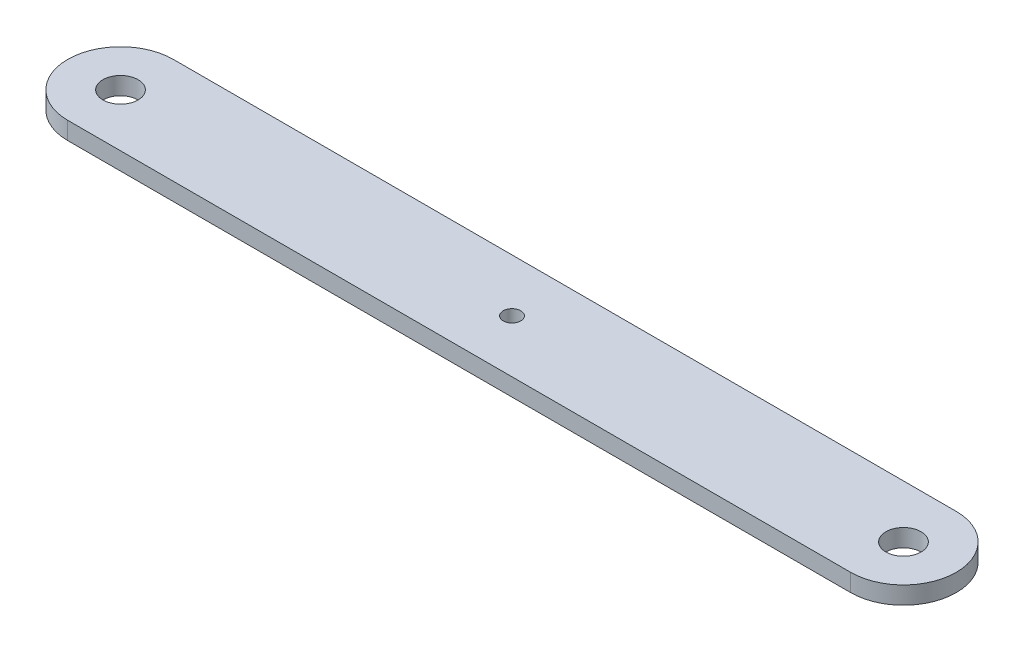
ISO-10303-21;
HEADER;
FILE_DESCRIPTION(('STEP AP214'),'2;1');
FILE_NAME('part.step','',(''),(''),'','','');
FILE_SCHEMA(('AUTOMOTIVE_DESIGN { 1 0 10303 214 1 1 1 1 }'));
ENDSEC;
DATA;
#1=APPLICATION_CONTEXT('core data for automotive mechanical design processes');
#2=APPLICATION_PROTOCOL_DEFINITION('international standard','automotive_design',2000,#1);
#3=PRODUCT_CONTEXT('',#1,'mechanical');
#4=PRODUCT('Part','Part','',(#3));
#5=PRODUCT_RELATED_PRODUCT_CATEGORY('part','',(#4));
#6=PRODUCT_DEFINITION_FORMATION('','',#4);
#7=PRODUCT_DEFINITION_CONTEXT('part definition',#1,'design');
#8=PRODUCT_DEFINITION('design','',#6,#7);
#9=PRODUCT_DEFINITION_SHAPE('','',#8);
#10=(LENGTH_UNIT() NAMED_UNIT(*) SI_UNIT(.MILLI.,.METRE.));
#11=(NAMED_UNIT(*) PLANE_ANGLE_UNIT() SI_UNIT($,.RADIAN.));
#12=(NAMED_UNIT(*) SI_UNIT($,.STERADIAN.) SOLID_ANGLE_UNIT());
#13=UNCERTAINTY_MEASURE_WITH_UNIT(LENGTH_MEASURE(1.E-05),#10,'distance_accuracy_value','');
#14=(GEOMETRIC_REPRESENTATION_CONTEXT(3) GLOBAL_UNCERTAINTY_ASSIGNED_CONTEXT((#13)) GLOBAL_UNIT_ASSIGNED_CONTEXT((#10,
#11,#12)) REPRESENTATION_CONTEXT('',''));
#15=CARTESIAN_POINT('',(0.,0.,0.));
#16=DIRECTION('',(0.,0.,1.));
#17=DIRECTION('',(1.,0.,0.));
#18=AXIS2_PLACEMENT_3D('',#15,#16,#17);
#19=CARTESIAN_POINT('',(141.2875,3.175,0.));
#20=DIRECTION('',(0.,-1.,0.));
#21=DIRECTION('',(0.,0.,-1.));
#22=AXIS2_PLACEMENT_3D('',#19,#20,#21);
#23=CYLINDRICAL_SURFACE('',#22,19.05);
#24=CARTESIAN_POINT('',(141.2875,-3.175,0.));
#25=DIRECTION('',(0.,1.,0.));
#26=DIRECTION('',(0.,0.,-1.));
#27=AXIS2_PLACEMENT_3D('',#24,#25,#26);
#28=CIRCLE('',#27,19.05);
#29=CARTESIAN_POINT('',(141.2875,-3.175,19.05));
#30=VERTEX_POINT('',#29);
#31=CARTESIAN_POINT('',(141.2875,-3.175,-19.05));
#32=VERTEX_POINT('',#31);
#33=EDGE_CURVE('E95',#30,#32,#28,.T.);
#34=ORIENTED_EDGE('',*,*,#33,.T.);
#35=DIRECTION('',(0.,-1.,0.));
#36=VECTOR('',#35,1.);
#37=CARTESIAN_POINT('',(141.2875,3.175,-19.05));
#38=LINE('',#37,#36);
#39=CARTESIAN_POINT('',(141.2875,3.175,-19.05));
#40=VERTEX_POINT('',#39);
#41=EDGE_CURVE('E11',#40,#32,#38,.T.);
#42=ORIENTED_EDGE('',*,*,#41,.F.);
#43=CARTESIAN_POINT('',(141.2875,3.175,0.));
#44=DIRECTION('',(0.,1.,0.));
#45=DIRECTION('',(0.,0.,-1.));
#46=AXIS2_PLACEMENT_3D('',#43,#44,#45);
#47=CIRCLE('',#46,19.05);
#48=CARTESIAN_POINT('',(141.2875,3.175,19.05));
#49=VERTEX_POINT('',#48);
#50=EDGE_CURVE('E83',#49,#40,#47,.T.);
#51=ORIENTED_EDGE('',*,*,#50,.F.);
#52=DIRECTION('',(0.,-1.,0.));
#53=VECTOR('',#52,1.);
#54=CARTESIAN_POINT('',(141.2875,3.175,19.05));
#55=LINE('',#54,#53);
#56=EDGE_CURVE('E91',#49,#30,#55,.T.);
#57=ORIENTED_EDGE('',*,*,#56,.T.);
#58=EDGE_LOOP('',(#34,#42,#51,#57));
#59=FACE_BOUND('',#58,.T.);
#60=ADVANCED_FACE('F32',(#59),#23,.T.);
#61=CARTESIAN_POINT('',(-141.2875,3.175,-19.05));
#62=DIRECTION('',(0.,0.,1.));
#63=DIRECTION('',(1.,0.,0.));
#64=AXIS2_PLACEMENT_3D('',#61,#62,#63);
#65=PLANE('',#64);
#66=DIRECTION('',(-1.,0.,0.));
#67=VECTOR('',#66,1.);
#68=CARTESIAN_POINT('',(-141.2875,-3.175,-19.05));
#69=LINE('',#68,#67);
#70=CARTESIAN_POINT('',(-141.2875,-3.175,-19.05));
#71=VERTEX_POINT('',#70);
#72=EDGE_CURVE('E87',#32,#71,#69,.T.);
#73=ORIENTED_EDGE('',*,*,#72,.T.);
#74=DIRECTION('',(0.,-1.,0.));
#75=VECTOR('',#74,1.);
#76=CARTESIAN_POINT('',(-141.2875,3.175,-19.05));
#77=LINE('',#76,#75);
#78=CARTESIAN_POINT('',(-141.2875,3.175,-19.05));
#79=VERTEX_POINT('',#78);
#80=EDGE_CURVE('E40',#79,#71,#77,.T.);
#81=ORIENTED_EDGE('',*,*,#80,.F.);
#82=DIRECTION('',(-1.,0.,0.));
#83=VECTOR('',#82,1.);
#84=CARTESIAN_POINT('',(-141.2875,3.175,-19.05));
#85=LINE('',#84,#83);
#86=EDGE_CURVE('E78',#40,#79,#85,.T.);
#87=ORIENTED_EDGE('',*,*,#86,.F.);
#88=ORIENTED_EDGE('',*,*,#41,.T.);
#89=EDGE_LOOP('',(#73,#81,#87,#88));
#90=FACE_BOUND('',#89,.T.);
#91=ADVANCED_FACE('F86',(#90),#65,.F.);
#92=CARTESIAN_POINT('',(-141.2875,3.175,0.));
#93=DIRECTION('',(0.,-1.,0.));
#94=DIRECTION('',(0.,0.,-1.));
#95=AXIS2_PLACEMENT_3D('',#92,#93,#94);
#96=CYLINDRICAL_SURFACE('',#95,19.05);
#97=CARTESIAN_POINT('',(-141.2875,-3.175,0.));
#98=DIRECTION('',(0.,1.,0.));
#99=DIRECTION('',(0.,0.,1.));
#100=AXIS2_PLACEMENT_3D('',#97,#98,#99);
#101=CIRCLE('',#100,19.05);
#102=CARTESIAN_POINT('',(-141.2875,-3.175,19.05));
#103=VERTEX_POINT('',#102);
#104=EDGE_CURVE('E65',#71,#103,#101,.T.);
#105=ORIENTED_EDGE('',*,*,#104,.T.);
#106=DIRECTION('',(0.,-1.,0.));
#107=VECTOR('',#106,1.);
#108=CARTESIAN_POINT('',(-141.2875,3.175,19.05));
#109=LINE('',#108,#107);
#110=CARTESIAN_POINT('',(-141.2875,3.175,19.05));
#111=VERTEX_POINT('',#110);
#112=EDGE_CURVE('E88',#111,#103,#109,.T.);
#113=ORIENTED_EDGE('',*,*,#112,.F.);
#114=CARTESIAN_POINT('',(-141.2875,3.175,0.));
#115=DIRECTION('',(0.,1.,0.));
#116=DIRECTION('',(0.,0.,1.));
#117=AXIS2_PLACEMENT_3D('',#114,#115,#116);
#118=CIRCLE('',#117,19.05);
#119=EDGE_CURVE('E81',#79,#111,#118,.T.);
#120=ORIENTED_EDGE('',*,*,#119,.F.);
#121=ORIENTED_EDGE('',*,*,#80,.T.);
#122=EDGE_LOOP('',(#105,#113,#120,#121));
#123=FACE_BOUND('',#122,.T.);
#124=ADVANCED_FACE('F89',(#123),#96,.T.);
#125=CARTESIAN_POINT('',(-141.2875,3.175,19.05));
#126=DIRECTION('',(0.,0.,-1.));
#127=DIRECTION('',(-1.,0.,0.));
#128=AXIS2_PLACEMENT_3D('',#125,#126,#127);
#129=PLANE('',#128);
#130=DIRECTION('',(1.,0.,0.));
#131=VECTOR('',#130,1.);
#132=CARTESIAN_POINT('',(-141.2875,-3.175,19.05));
#133=LINE('',#132,#131);
#134=EDGE_CURVE('E71',#103,#30,#133,.T.);
#135=ORIENTED_EDGE('',*,*,#134,.T.);
#136=ORIENTED_EDGE('',*,*,#56,.F.);
#137=DIRECTION('',(1.,0.,0.));
#138=VECTOR('',#137,1.);
#139=CARTESIAN_POINT('',(-141.2875,3.175,19.05));
#140=LINE('',#139,#138);
#141=EDGE_CURVE('E48',#111,#49,#140,.T.);
#142=ORIENTED_EDGE('',*,*,#141,.F.);
#143=ORIENTED_EDGE('',*,*,#112,.T.);
#144=EDGE_LOOP('',(#135,#136,#142,#143));
#145=FACE_BOUND('',#144,.T.);
#146=ADVANCED_FACE('F103',(#145),#129,.F.);
#147=CARTESIAN_POINT('',(141.2875,3.175,0.));
#148=DIRECTION('',(0.,-1.,0.));
#149=DIRECTION('',(0.,0.,-1.));
#150=AXIS2_PLACEMENT_3D('',#147,#148,#149);
#151=PLANE('',#150);
#152=CARTESIAN_POINT('',(0.,3.175,0.));
#153=DIRECTION('',(0.,1.,0.));
#154=DIRECTION('',(0.,0.,1.));
#155=AXIS2_PLACEMENT_3D('',#152,#153,#154);
#156=CIRCLE('',#155,3.175);
#157=CARTESIAN_POINT('',(0.,3.175,3.175));
#158=VERTEX_POINT('',#157);
#159=EDGE_CURVE('E121',#158,#158,#156,.T.);
#160=ORIENTED_EDGE('',*,*,#159,.F.);
#161=EDGE_LOOP('',(#160));
#162=FACE_BOUND('',#161,.T.);
#163=CARTESIAN_POINT('',(141.2875,3.175,0.));
#164=DIRECTION('',(0.,1.,0.));
#165=DIRECTION('',(0.,0.,-1.));
#166=AXIS2_PLACEMENT_3D('',#163,#164,#165);
#167=CIRCLE('',#166,6.35);
#168=CARTESIAN_POINT('',(141.2875,3.175,-6.35));
#169=VERTEX_POINT('',#168);
#170=EDGE_CURVE('E115',#169,#169,#167,.T.);
#171=ORIENTED_EDGE('',*,*,#170,.F.);
#172=EDGE_LOOP('',(#171));
#173=FACE_BOUND('',#172,.T.);
#174=CARTESIAN_POINT('',(-141.2875,3.175,0.));
#175=DIRECTION('',(0.,1.,0.));
#176=DIRECTION('',(0.,0.,1.));
#177=AXIS2_PLACEMENT_3D('',#174,#175,#176);
#178=CIRCLE('',#177,6.35);
#179=CARTESIAN_POINT('',(-141.2875,3.175,6.34999999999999));
#180=VERTEX_POINT('',#179);
#181=EDGE_CURVE('E109',#180,#180,#178,.T.);
#182=ORIENTED_EDGE('',*,*,#181,.F.);
#183=EDGE_LOOP('',(#182));
#184=FACE_BOUND('',#183,.T.);
#185=ORIENTED_EDGE('',*,*,#50,.T.);
#186=ORIENTED_EDGE('',*,*,#86,.T.);
#187=ORIENTED_EDGE('',*,*,#119,.T.);
#188=ORIENTED_EDGE('',*,*,#141,.T.);
#189=EDGE_LOOP('',(#185,#186,#187,#188));
#190=FACE_BOUND('',#189,.T.);
#191=ADVANCED_FACE('F79',(#162,#173,#184,#190),#151,.F.);
#192=CARTESIAN_POINT('',(141.2875,-3.175,0.));
#193=DIRECTION('',(0.,-1.,0.));
#194=DIRECTION('',(0.,0.,-1.));
#195=AXIS2_PLACEMENT_3D('',#192,#193,#194);
#196=PLANE('',#195);
#197=CARTESIAN_POINT('',(0.,-3.175,0.));
#198=DIRECTION('',(0.,1.,0.));
#199=DIRECTION('',(0.,0.,1.));
#200=AXIS2_PLACEMENT_3D('',#197,#198,#199);
#201=CIRCLE('',#200,3.175);
#202=CARTESIAN_POINT('',(0.,-3.175,3.175));
#203=VERTEX_POINT('',#202);
#204=EDGE_CURVE('E118',#203,#203,#201,.T.);
#205=ORIENTED_EDGE('',*,*,#204,.T.);
#206=EDGE_LOOP('',(#205));
#207=FACE_BOUND('',#206,.T.);
#208=CARTESIAN_POINT('',(141.2875,-3.175,0.));
#209=DIRECTION('',(0.,1.,0.));
#210=DIRECTION('',(0.,0.,-1.));
#211=AXIS2_PLACEMENT_3D('',#208,#209,#210);
#212=CIRCLE('',#211,6.35);
#213=CARTESIAN_POINT('',(141.2875,-3.175,-6.35));
#214=VERTEX_POINT('',#213);
#215=EDGE_CURVE('E112',#214,#214,#212,.T.);
#216=ORIENTED_EDGE('',*,*,#215,.T.);
#217=EDGE_LOOP('',(#216));
#218=FACE_BOUND('',#217,.T.);
#219=CARTESIAN_POINT('',(-141.2875,-3.175,0.));
#220=DIRECTION('',(0.,1.,0.));
#221=DIRECTION('',(0.,0.,1.));
#222=AXIS2_PLACEMENT_3D('',#219,#220,#221);
#223=CIRCLE('',#222,6.35);
#224=CARTESIAN_POINT('',(-141.2875,-3.175,6.34999999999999));
#225=VERTEX_POINT('',#224);
#226=EDGE_CURVE('E98',#225,#225,#223,.T.);
#227=ORIENTED_EDGE('',*,*,#226,.T.);
#228=EDGE_LOOP('',(#227));
#229=FACE_BOUND('',#228,.T.);
#230=ORIENTED_EDGE('',*,*,#33,.F.);
#231=ORIENTED_EDGE('',*,*,#134,.F.);
#232=ORIENTED_EDGE('',*,*,#104,.F.);
#233=ORIENTED_EDGE('',*,*,#72,.F.);
#234=EDGE_LOOP('',(#230,#231,#232,#233));
#235=FACE_BOUND('',#234,.T.);
#236=ADVANCED_FACE('F106',(#207,#218,#229,#235),#196,.T.);
#237=CARTESIAN_POINT('',(-141.2875,-3.175,0.));
#238=DIRECTION('',(0.,1.,0.));
#239=DIRECTION('',(0.,0.,1.));
#240=AXIS2_PLACEMENT_3D('',#237,#238,#239);
#241=CYLINDRICAL_SURFACE('',#240,6.35);
#242=ORIENTED_EDGE('',*,*,#226,.F.);
#243=EDGE_LOOP('',(#242));
#244=FACE_BOUND('',#243,.T.);
#245=ORIENTED_EDGE('',*,*,#181,.T.);
#246=EDGE_LOOP('',(#245));
#247=FACE_BOUND('',#246,.T.);
#248=ADVANCED_FACE('F143',(#244,#247),#241,.F.);
#249=CARTESIAN_POINT('',(141.2875,-3.175,0.));
#250=DIRECTION('',(0.,1.,0.));
#251=DIRECTION('',(0.,0.,1.));
#252=AXIS2_PLACEMENT_3D('',#249,#250,#251);
#253=CYLINDRICAL_SURFACE('',#252,6.35);
#254=ORIENTED_EDGE('',*,*,#215,.F.);
#255=EDGE_LOOP('',(#254));
#256=FACE_BOUND('',#255,.T.);
#257=ORIENTED_EDGE('',*,*,#170,.T.);
#258=EDGE_LOOP('',(#257));
#259=FACE_BOUND('',#258,.T.);
#260=ADVANCED_FACE('F132',(#256,#259),#253,.F.);
#261=CARTESIAN_POINT('',(0.,-3.175,0.));
#262=DIRECTION('',(0.,1.,0.));
#263=DIRECTION('',(0.,0.,1.));
#264=AXIS2_PLACEMENT_3D('',#261,#262,#263);
#265=CYLINDRICAL_SURFACE('',#264,3.175);
#266=ORIENTED_EDGE('',*,*,#204,.F.);
#267=EDGE_LOOP('',(#266));
#268=FACE_BOUND('',#267,.T.);
#269=ORIENTED_EDGE('',*,*,#159,.T.);
#270=EDGE_LOOP('',(#269));
#271=FACE_BOUND('',#270,.T.);
#272=ADVANCED_FACE('F129',(#268,#271),#265,.F.);
#273=CLOSED_SHELL('',(#60,#91,#124,#146,#191,#236,#248,#260,#272));
#274=MANIFOLD_SOLID_BREP('B2',#273);
#275=ADVANCED_BREP_SHAPE_REPRESENTATION('',(#18,#274),#14);
#276=SHAPE_DEFINITION_REPRESENTATION(#9,#275);
ENDSEC;
END-ISO-10303-21;
